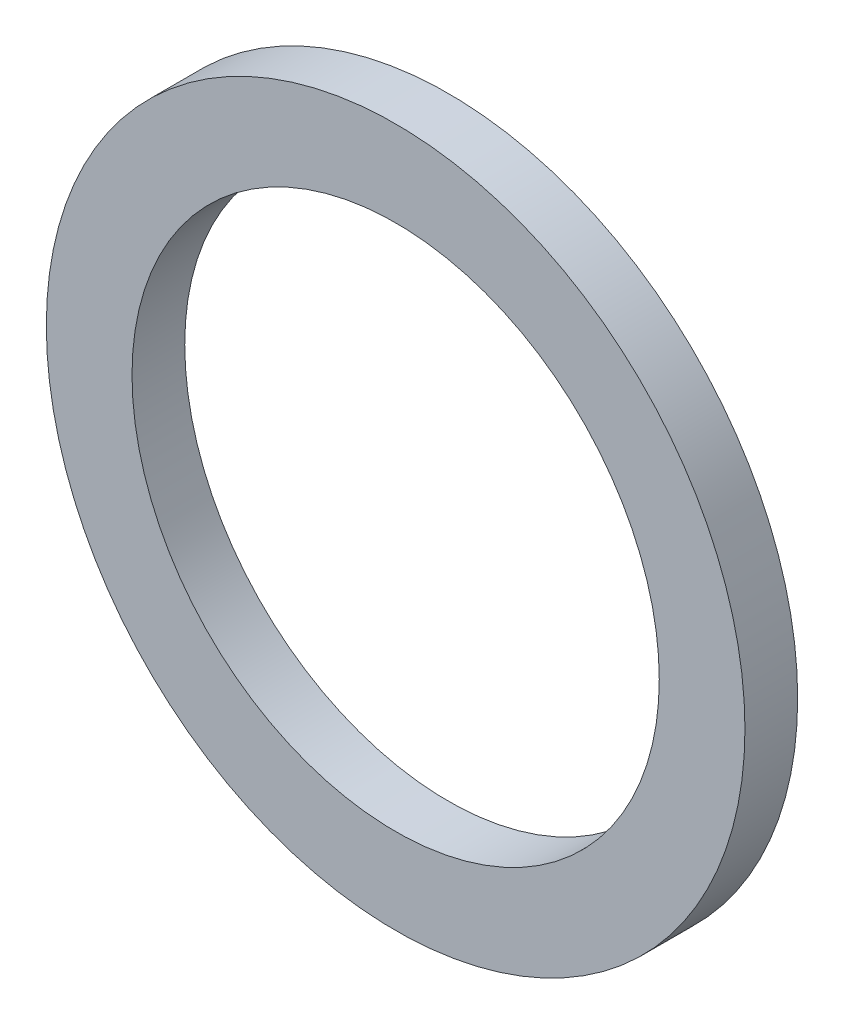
ISO-10303-21;
HEADER;
FILE_DESCRIPTION(('STEP AP214'),'2;1');
FILE_NAME('part.step','',(''),(''),'','','');
FILE_SCHEMA(('AUTOMOTIVE_DESIGN { 1 0 10303 214 1 1 1 1 }'));
ENDSEC;
DATA;
#1=APPLICATION_CONTEXT('core data for automotive mechanical design processes');
#2=APPLICATION_PROTOCOL_DEFINITION('international standard','automotive_design',2000,#1);
#3=PRODUCT_CONTEXT('',#1,'mechanical');
#4=PRODUCT('Part','Part','',(#3));
#5=PRODUCT_RELATED_PRODUCT_CATEGORY('part','',(#4));
#6=PRODUCT_DEFINITION_FORMATION('','',#4);
#7=PRODUCT_DEFINITION_CONTEXT('part definition',#1,'design');
#8=PRODUCT_DEFINITION('design','',#6,#7);
#9=PRODUCT_DEFINITION_SHAPE('','',#8);
#10=(LENGTH_UNIT() NAMED_UNIT(*) SI_UNIT(.MILLI.,.METRE.));
#11=(NAMED_UNIT(*) PLANE_ANGLE_UNIT() SI_UNIT($,.RADIAN.));
#12=(NAMED_UNIT(*) SI_UNIT($,.STERADIAN.) SOLID_ANGLE_UNIT());
#13=UNCERTAINTY_MEASURE_WITH_UNIT(LENGTH_MEASURE(1.E-05),#10,'distance_accuracy_value','');
#14=(GEOMETRIC_REPRESENTATION_CONTEXT(3) GLOBAL_UNCERTAINTY_ASSIGNED_CONTEXT((#13)) GLOBAL_UNIT_ASSIGNED_CONTEXT((#10,
#11,#12)) REPRESENTATION_CONTEXT('',''));
#15=CARTESIAN_POINT('',(0.,0.,0.));
#16=DIRECTION('',(0.,0.,1.));
#17=DIRECTION('',(1.,0.,0.));
#18=AXIS2_PLACEMENT_3D('',#15,#16,#17);
#19=CARTESIAN_POINT('',(0.,0.,0.400000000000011));
#20=DIRECTION('',(0.,0.,0.999999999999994));
#21=DIRECTION('',(1.00000000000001,0.,0.));
#22=AXIS2_PLACEMENT_3D('',#19,#20,#21);
#23=PLANE('',#22);
#24=CARTESIAN_POINT('',(0.,0.,0.400000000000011));
#25=DIRECTION('',(0.,0.,0.999999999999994));
#26=DIRECTION('',(1.00000000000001,0.,0.));
#27=AXIS2_PLACEMENT_3D('',#24,#25,#26);
#28=CIRCLE('',#27,2.65);
#29=CARTESIAN_POINT('',(-2.65000000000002,0.,0.400000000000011));
#30=VERTEX_POINT('',#29);
#31=EDGE_CURVE('E10',#30,#30,#28,.T.);
#32=ORIENTED_EDGE('',*,*,#31,.T.);
#33=EDGE_LOOP('',(#32));
#34=FACE_BOUND('',#33,.T.);
#35=CARTESIAN_POINT('',(0.,0.,0.400000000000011));
#36=DIRECTION('',(0.,0.,0.999999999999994));
#37=DIRECTION('',(1.00000000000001,0.,0.));
#38=AXIS2_PLACEMENT_3D('',#35,#36,#37);
#39=CIRCLE('',#38,2.);
#40=CARTESIAN_POINT('',(-2.00000000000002,0.,0.400000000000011));
#41=VERTEX_POINT('',#40);
#42=EDGE_CURVE('E39',#41,#41,#39,.T.);
#43=ORIENTED_EDGE('',*,*,#42,.F.);
#44=EDGE_LOOP('',(#43));
#45=FACE_BOUND('',#44,.T.);
#46=ADVANCED_FACE('F28',(#34,#45),#23,.T.);
#47=CARTESIAN_POINT('',(0.,0.,0.));
#48=DIRECTION('',(0.,0.,0.999999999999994));
#49=DIRECTION('',(1.00000000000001,0.,0.));
#50=AXIS2_PLACEMENT_3D('',#47,#48,#49);
#51=PLANE('',#50);
#52=CARTESIAN_POINT('',(0.,0.,0.));
#53=DIRECTION('',(0.,0.,0.999999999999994));
#54=DIRECTION('',(1.00000000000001,0.,0.));
#55=AXIS2_PLACEMENT_3D('',#52,#53,#54);
#56=CIRCLE('',#55,2.65);
#57=CARTESIAN_POINT('',(-2.65000000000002,0.,0.));
#58=VERTEX_POINT('',#57);
#59=EDGE_CURVE('E35',#58,#58,#56,.T.);
#60=ORIENTED_EDGE('',*,*,#59,.F.);
#61=EDGE_LOOP('',(#60));
#62=FACE_BOUND('',#61,.T.);
#63=CARTESIAN_POINT('',(0.,0.,0.));
#64=DIRECTION('',(0.,0.,0.999999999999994));
#65=DIRECTION('',(1.00000000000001,0.,0.));
#66=AXIS2_PLACEMENT_3D('',#63,#64,#65);
#67=CIRCLE('',#66,2.);
#68=CARTESIAN_POINT('',(-2.00000000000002,0.,0.));
#69=VERTEX_POINT('',#68);
#70=EDGE_CURVE('E43',#69,#69,#67,.T.);
#71=ORIENTED_EDGE('',*,*,#70,.T.);
#72=EDGE_LOOP('',(#71));
#73=FACE_BOUND('',#72,.T.);
#74=ADVANCED_FACE('F49',(#62,#73),#51,.F.);
#75=CARTESIAN_POINT('',(0.,0.,0.400000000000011));
#76=DIRECTION('',(0.,0.,-0.999999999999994));
#77=DIRECTION('',(-1.00000000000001,0.,0.));
#78=AXIS2_PLACEMENT_3D('',#75,#76,#77);
#79=CYLINDRICAL_SURFACE('',#78,2.65);
#80=CARTESIAN_POINT('',(-2.65000000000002,0.,0.400000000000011));
#81=CARTESIAN_POINT('',(-2.65000000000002,0.,0.395833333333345));
#82=CARTESIAN_POINT('',(-2.65000000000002,0.,0.391666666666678));
#83=CARTESIAN_POINT('',(-2.65000000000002,0.,0.383333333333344));
#84=CARTESIAN_POINT('',(-2.65000000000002,0.,0.379166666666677));
#85=CARTESIAN_POINT('',(-2.65000000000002,0.,0.370833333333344));
#86=CARTESIAN_POINT('',(-2.65000000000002,0.,0.366666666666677));
#87=CARTESIAN_POINT('',(-2.65000000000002,0.,0.358333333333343));
#88=CARTESIAN_POINT('',(-2.65000000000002,0.,0.354166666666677));
#89=CARTESIAN_POINT('',(-2.65000000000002,0.,0.345833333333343));
#90=CARTESIAN_POINT('',(-2.65000000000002,0.,0.341666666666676));
#91=CARTESIAN_POINT('',(-2.65000000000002,0.,0.333333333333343));
#92=CARTESIAN_POINT('',(-2.65000000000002,0.,0.329166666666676));
#93=CARTESIAN_POINT('',(-2.65000000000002,0.,0.320833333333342));
#94=CARTESIAN_POINT('',(-2.65000000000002,0.,0.316666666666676));
#95=CARTESIAN_POINT('',(-2.65000000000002,0.,0.308333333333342));
#96=CARTESIAN_POINT('',(-2.65000000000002,0.,0.304166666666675));
#97=CARTESIAN_POINT('',(-2.65000000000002,0.,0.295833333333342));
#98=CARTESIAN_POINT('',(-2.65000000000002,0.,0.291666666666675));
#99=CARTESIAN_POINT('',(-2.65000000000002,0.,0.283333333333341));
#100=CARTESIAN_POINT('',(-2.65000000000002,0.,0.279166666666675));
#101=CARTESIAN_POINT('',(-2.65000000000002,0.,0.270833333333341));
#102=CARTESIAN_POINT('',(-2.65000000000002,0.,0.266666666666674));
#103=CARTESIAN_POINT('',(-2.65000000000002,0.,0.258333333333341));
#104=CARTESIAN_POINT('',(-2.65000000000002,0.,0.254166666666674));
#105=CARTESIAN_POINT('',(-2.65000000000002,0.,0.24583333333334));
#106=CARTESIAN_POINT('',(-2.65000000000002,0.,0.241666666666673));
#107=CARTESIAN_POINT('',(-2.65000000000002,0.,0.23333333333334));
#108=CARTESIAN_POINT('',(-2.65000000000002,0.,0.229166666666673));
#109=CARTESIAN_POINT('',(-2.65000000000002,0.,0.22083333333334));
#110=CARTESIAN_POINT('',(-2.65000000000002,0.,0.216666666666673));
#111=CARTESIAN_POINT('',(-2.65000000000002,0.,0.208333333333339));
#112=CARTESIAN_POINT('',(-2.65000000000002,0.,0.204166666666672));
#113=CARTESIAN_POINT('',(-2.65000000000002,0.,0.195833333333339));
#114=CARTESIAN_POINT('',(-2.65000000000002,0.,0.191666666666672));
#115=CARTESIAN_POINT('',(-2.65000000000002,0.,0.183333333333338));
#116=CARTESIAN_POINT('',(-2.65000000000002,0.,0.179166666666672));
#117=CARTESIAN_POINT('',(-2.65000000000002,0.,0.170833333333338));
#118=CARTESIAN_POINT('',(-2.65000000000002,0.,0.166666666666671));
#119=CARTESIAN_POINT('',(-2.65000000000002,0.,0.158333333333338));
#120=CARTESIAN_POINT('',(-2.65000000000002,0.,0.154166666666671));
#121=CARTESIAN_POINT('',(-2.65000000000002,0.,0.145833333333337));
#122=CARTESIAN_POINT('',(-2.65000000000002,0.,0.141666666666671));
#123=CARTESIAN_POINT('',(-2.65000000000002,0.,0.133333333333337));
#124=CARTESIAN_POINT('',(-2.65000000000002,0.,0.12916666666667));
#125=CARTESIAN_POINT('',(-2.65000000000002,0.,0.120833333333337));
#126=CARTESIAN_POINT('',(-2.65000000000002,0.,0.11666666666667));
#127=CARTESIAN_POINT('',(-2.65000000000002,0.,0.108333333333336));
#128=CARTESIAN_POINT('',(-2.65000000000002,0.,0.10416666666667));
#129=CARTESIAN_POINT('',(-2.65000000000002,0.,0.095833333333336));
#130=CARTESIAN_POINT('',(-2.65000000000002,0.,0.0916666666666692));
#131=CARTESIAN_POINT('',(-2.65000000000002,0.,0.0833333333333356));
#132=CARTESIAN_POINT('',(-2.65000000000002,0.,0.0791666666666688));
#133=CARTESIAN_POINT('',(-2.65000000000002,0.,0.0708333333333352));
#134=CARTESIAN_POINT('',(-2.65000000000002,0.,0.0666666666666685));
#135=CARTESIAN_POINT('',(-2.65000000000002,0.,0.0583333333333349));
#136=CARTESIAN_POINT('',(-2.65000000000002,0.,0.0541666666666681));
#137=CARTESIAN_POINT('',(-2.65000000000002,0.,0.0458333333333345));
#138=CARTESIAN_POINT('',(-2.65000000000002,0.,0.0416666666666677));
#139=CARTESIAN_POINT('',(-2.65000000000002,0.,0.0333333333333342));
#140=CARTESIAN_POINT('',(-2.65000000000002,0.,0.0291666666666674));
#141=CARTESIAN_POINT('',(-2.65000000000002,0.,0.0208333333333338));
#142=CARTESIAN_POINT('',(-2.65000000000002,0.,0.016666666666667));
#143=CARTESIAN_POINT('',(-2.65000000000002,0.,0.00833333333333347));
#144=CARTESIAN_POINT('',(-2.65000000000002,0.,0.00416666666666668));
#145=CARTESIAN_POINT('',(-2.65000000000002,0.,0.));
#146=B_SPLINE_CURVE_WITH_KNOTS('',3,(#80,#81,#82,#83,#84,#85,#86,#87,#88,#89,#90,#91,#92,#93,
#94,#95,#96,#97,#98,#99,#100,#101,#102,#103,#104,#105,#106,#107,#108,#109,#110,#111,#112,#113,
#114,#115,#116,#117,#118,#119,#120,#121,#122,#123,#124,#125,#126,#127,#128,#129,#130,#131,#132,
#133,#134,#135,#136,#137,#138,#139,#140,#141,#142,#143,#144,#145),.UNSPECIFIED.,.F.,.F.,(4,2,2,
2,2,2,2,2,2,2,2,2,2,2,2,2,2,2,2,2,2,2,2,2,2,2,2,2,2,2,2,2,4),(0.,0.0125000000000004,
0.0250000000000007,0.0375000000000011,0.0500000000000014,0.0625000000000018,0.0750000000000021,
0.0875000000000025,0.100000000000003,0.112500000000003,0.125000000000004,0.137500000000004,
0.150000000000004,0.162500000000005,0.175000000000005,0.187500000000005,0.200000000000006,
0.212500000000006,0.225000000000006,0.237500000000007,0.250000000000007,0.262500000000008,
0.275000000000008,0.287500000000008,0.300000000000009,0.312500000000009,0.325000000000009,
0.33750000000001,0.35000000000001,0.36250000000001,0.375000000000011,0.387500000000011,
0.400000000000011),.UNSPECIFIED.);
#147=EDGE_CURVE('BSEAM30',#30,#58,#146,.T.);
#148=ORIENTED_EDGE('',*,*,#31,.F.);
#149=ORIENTED_EDGE('',*,*,#59,.T.);
#150=ORIENTED_EDGE('',*,*,#147,.T.);
#151=ORIENTED_EDGE('',*,*,#147,.F.);
#152=EDGE_LOOP('',(#148,#150,#149,#151));
#153=FACE_BOUND('',#152,.T.);
#154=ADVANCED_FACE('F30',(#153),#79,.T.);
#155=CARTESIAN_POINT('',(0.,0.,0.400000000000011));
#156=DIRECTION('',(0.,0.,-0.999999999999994));
#157=DIRECTION('',(-1.00000000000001,0.,0.));
#158=AXIS2_PLACEMENT_3D('',#155,#156,#157);
#159=CYLINDRICAL_SURFACE('',#158,2.);
#160=CARTESIAN_POINT('',(-2.00000000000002,0.,0.400000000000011));
#161=CARTESIAN_POINT('',(-2.00000000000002,0.,0.395833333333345));
#162=CARTESIAN_POINT('',(-2.00000000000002,0.,0.391666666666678));
#163=CARTESIAN_POINT('',(-2.00000000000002,0.,0.383333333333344));
#164=CARTESIAN_POINT('',(-2.00000000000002,0.,0.379166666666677));
#165=CARTESIAN_POINT('',(-2.00000000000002,0.,0.370833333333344));
#166=CARTESIAN_POINT('',(-2.00000000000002,0.,0.366666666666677));
#167=CARTESIAN_POINT('',(-2.00000000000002,0.,0.358333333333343));
#168=CARTESIAN_POINT('',(-2.00000000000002,0.,0.354166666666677));
#169=CARTESIAN_POINT('',(-2.00000000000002,0.,0.345833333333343));
#170=CARTESIAN_POINT('',(-2.00000000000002,0.,0.341666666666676));
#171=CARTESIAN_POINT('',(-2.00000000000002,0.,0.333333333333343));
#172=CARTESIAN_POINT('',(-2.00000000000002,0.,0.329166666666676));
#173=CARTESIAN_POINT('',(-2.00000000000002,0.,0.320833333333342));
#174=CARTESIAN_POINT('',(-2.00000000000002,0.,0.316666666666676));
#175=CARTESIAN_POINT('',(-2.00000000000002,0.,0.308333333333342));
#176=CARTESIAN_POINT('',(-2.00000000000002,0.,0.304166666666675));
#177=CARTESIAN_POINT('',(-2.00000000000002,0.,0.295833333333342));
#178=CARTESIAN_POINT('',(-2.00000000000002,0.,0.291666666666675));
#179=CARTESIAN_POINT('',(-2.00000000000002,0.,0.283333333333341));
#180=CARTESIAN_POINT('',(-2.00000000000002,0.,0.279166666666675));
#181=CARTESIAN_POINT('',(-2.00000000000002,0.,0.270833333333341));
#182=CARTESIAN_POINT('',(-2.00000000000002,0.,0.266666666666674));
#183=CARTESIAN_POINT('',(-2.00000000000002,0.,0.258333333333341));
#184=CARTESIAN_POINT('',(-2.00000000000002,0.,0.254166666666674));
#185=CARTESIAN_POINT('',(-2.00000000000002,0.,0.24583333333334));
#186=CARTESIAN_POINT('',(-2.00000000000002,0.,0.241666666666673));
#187=CARTESIAN_POINT('',(-2.00000000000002,0.,0.23333333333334));
#188=CARTESIAN_POINT('',(-2.00000000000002,0.,0.229166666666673));
#189=CARTESIAN_POINT('',(-2.00000000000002,0.,0.22083333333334));
#190=CARTESIAN_POINT('',(-2.00000000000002,0.,0.216666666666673));
#191=CARTESIAN_POINT('',(-2.00000000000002,0.,0.208333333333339));
#192=CARTESIAN_POINT('',(-2.00000000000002,0.,0.204166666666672));
#193=CARTESIAN_POINT('',(-2.00000000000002,0.,0.195833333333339));
#194=CARTESIAN_POINT('',(-2.00000000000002,0.,0.191666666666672));
#195=CARTESIAN_POINT('',(-2.00000000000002,0.,0.183333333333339));
#196=CARTESIAN_POINT('',(-2.00000000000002,0.,0.179166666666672));
#197=CARTESIAN_POINT('',(-2.00000000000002,0.,0.170833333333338));
#198=CARTESIAN_POINT('',(-2.00000000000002,0.,0.166666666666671));
#199=CARTESIAN_POINT('',(-2.00000000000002,0.,0.158333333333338));
#200=CARTESIAN_POINT('',(-2.00000000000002,0.,0.154166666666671));
#201=CARTESIAN_POINT('',(-2.00000000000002,0.,0.145833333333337));
#202=CARTESIAN_POINT('',(-2.00000000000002,0.,0.141666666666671));
#203=CARTESIAN_POINT('',(-2.00000000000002,0.,0.133333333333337));
#204=CARTESIAN_POINT('',(-2.00000000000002,0.,0.12916666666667));
#205=CARTESIAN_POINT('',(-2.00000000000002,0.,0.120833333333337));
#206=CARTESIAN_POINT('',(-2.00000000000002,0.,0.11666666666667));
#207=CARTESIAN_POINT('',(-2.00000000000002,0.,0.108333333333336));
#208=CARTESIAN_POINT('',(-2.00000000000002,0.,0.10416666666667));
#209=CARTESIAN_POINT('',(-2.00000000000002,0.,0.095833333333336));
#210=CARTESIAN_POINT('',(-2.00000000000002,0.,0.0916666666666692));
#211=CARTESIAN_POINT('',(-2.00000000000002,0.,0.0833333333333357));
#212=CARTESIAN_POINT('',(-2.00000000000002,0.,0.0791666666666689));
#213=CARTESIAN_POINT('',(-2.00000000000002,0.,0.0708333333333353));
#214=CARTESIAN_POINT('',(-2.00000000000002,0.,0.0666666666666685));
#215=CARTESIAN_POINT('',(-2.00000000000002,0.,0.058333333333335));
#216=CARTESIAN_POINT('',(-2.00000000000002,0.,0.0541666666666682));
#217=CARTESIAN_POINT('',(-2.00000000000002,0.,0.0458333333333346));
#218=CARTESIAN_POINT('',(-2.00000000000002,0.,0.0416666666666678));
#219=CARTESIAN_POINT('',(-2.00000000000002,0.,0.0333333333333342));
#220=CARTESIAN_POINT('',(-2.00000000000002,0.,0.0291666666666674));
#221=CARTESIAN_POINT('',(-2.00000000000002,0.,0.0208333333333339));
#222=CARTESIAN_POINT('',(-2.00000000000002,0.,0.0166666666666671));
#223=CARTESIAN_POINT('',(-2.00000000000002,0.,0.00833333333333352));
#224=CARTESIAN_POINT('',(-2.00000000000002,0.,0.00416666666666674));
#225=CARTESIAN_POINT('',(-2.00000000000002,0.,0.));
#226=B_SPLINE_CURVE_WITH_KNOTS('',3,(#160,#161,#162,#163,#164,#165,#166,#167,#168,#169,#170,
#171,#172,#173,#174,#175,#176,#177,#178,#179,#180,#181,#182,#183,#184,#185,#186,#187,#188,#189,
#190,#191,#192,#193,#194,#195,#196,#197,#198,#199,#200,#201,#202,#203,#204,#205,#206,#207,#208,
#209,#210,#211,#212,#213,#214,#215,#216,#217,#218,#219,#220,#221,#222,#223,#224,#225),
.UNSPECIFIED.,.F.,.F.,(4,2,2,2,2,2,2,2,2,2,2,2,2,2,2,2,2,2,2,2,2,2,2,2,2,2,2,2,2,2,2,2,4),(0.,
0.0125000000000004,0.0250000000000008,0.0375000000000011,0.0500000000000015,0.0625000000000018,
0.0750000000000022,0.0875000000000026,0.100000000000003,0.112500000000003,0.125000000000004,
0.137500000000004,0.150000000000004,0.162500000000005,0.175000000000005,0.187500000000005,
0.200000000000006,0.212500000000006,0.225000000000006,0.237500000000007,0.250000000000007,
0.262500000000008,0.275000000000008,0.287500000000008,0.300000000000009,0.312500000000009,
0.325000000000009,0.33750000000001,0.35000000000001,0.36250000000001,0.375000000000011,
0.387500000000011,0.400000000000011),.UNSPECIFIED.);
#227=EDGE_CURVE('BSEAM51',#41,#69,#226,.T.);
#228=ORIENTED_EDGE('',*,*,#42,.T.);
#229=ORIENTED_EDGE('',*,*,#70,.F.);
#230=ORIENTED_EDGE('',*,*,#227,.T.);
#231=ORIENTED_EDGE('',*,*,#227,.F.);
#232=EDGE_LOOP('',(#228,#230,#229,#231));
#233=FACE_BOUND('',#232,.T.);
#234=ADVANCED_FACE('F51',(#233),#159,.F.);
#235=CLOSED_SHELL('',(#46,#74,#154,#234));
#236=MANIFOLD_SOLID_BREP('B2',#235);
#237=ADVANCED_BREP_SHAPE_REPRESENTATION('',(#18,#236),#14);
#238=SHAPE_DEFINITION_REPRESENTATION(#9,#237);
ENDSEC;
END-ISO-10303-21;
